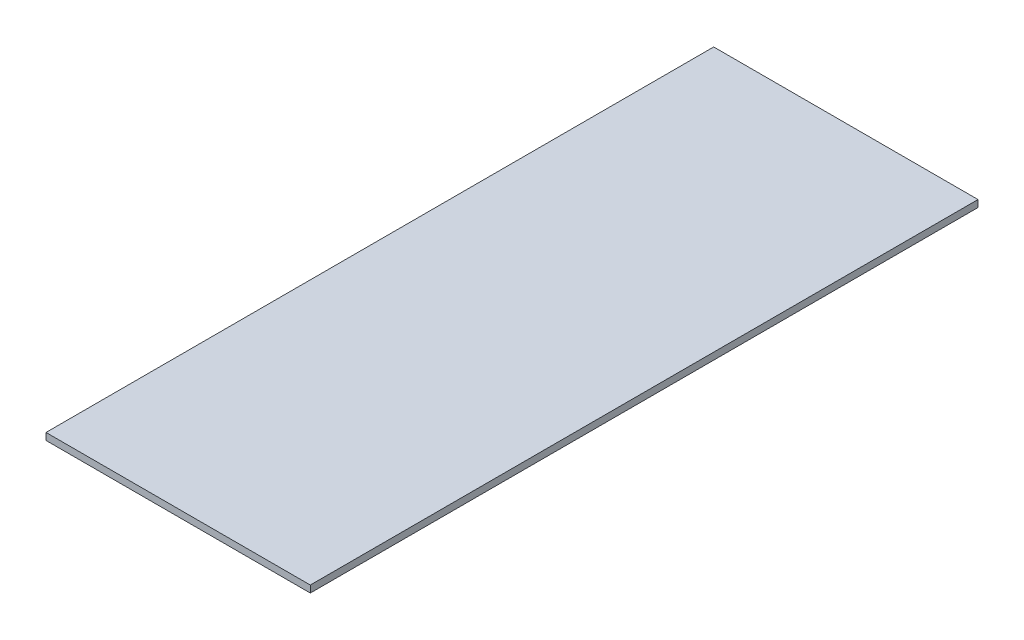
from build123d import *

# Parameters (mm, degrees)
SKETCH1_W           = 180.975
SKETCH1_H           = 457.2
BOSS_EXTRUDE1_DEPTH = 4.7625


with BuildPart() as part:
    # Sketch1 → Boss-Extrude1 (new body)
    with BuildSketch(Plane(origin=(0, 0, 0), x_dir=(1, 0, 0), z_dir=(0, 1, 0))):
        with Locations((90.4875, 228.6)):
            Rectangle(SKETCH1_W, SKETCH1_H)
    extrude(amount=BOSS_EXTRUDE1_DEPTH)


solid = part.part
